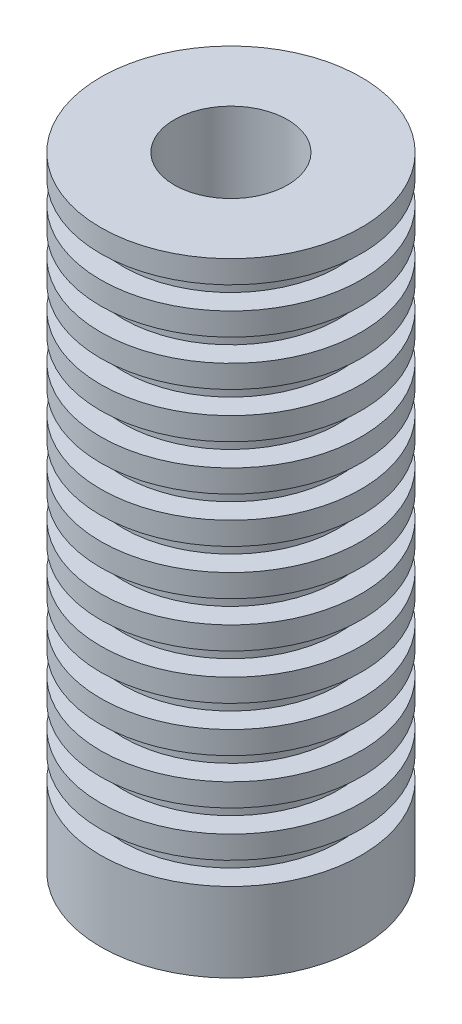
ISO-10303-21;
HEADER;
FILE_DESCRIPTION(('STEP AP214'),'2;1');
FILE_NAME('part.step','',(''),(''),'','','');
FILE_SCHEMA(('AUTOMOTIVE_DESIGN { 1 0 10303 214 1 1 1 1 }'));
ENDSEC;
DATA;
#1=APPLICATION_CONTEXT('core data for automotive mechanical design processes');
#2=APPLICATION_PROTOCOL_DEFINITION('international standard','automotive_design',2000,#1);
#3=PRODUCT_CONTEXT('',#1,'mechanical');
#4=PRODUCT('Part','Part','',(#3));
#5=PRODUCT_RELATED_PRODUCT_CATEGORY('part','',(#4));
#6=PRODUCT_DEFINITION_FORMATION('','',#4);
#7=PRODUCT_DEFINITION_CONTEXT('part definition',#1,'design');
#8=PRODUCT_DEFINITION('design','',#6,#7);
#9=PRODUCT_DEFINITION_SHAPE('','',#8);
#10=(LENGTH_UNIT() NAMED_UNIT(*) SI_UNIT(.MILLI.,.METRE.));
#11=(NAMED_UNIT(*) PLANE_ANGLE_UNIT() SI_UNIT($,.RADIAN.));
#12=(NAMED_UNIT(*) SI_UNIT($,.STERADIAN.) SOLID_ANGLE_UNIT());
#13=UNCERTAINTY_MEASURE_WITH_UNIT(LENGTH_MEASURE(1.E-05),#10,'distance_accuracy_value','');
#14=(GEOMETRIC_REPRESENTATION_CONTEXT(3) GLOBAL_UNCERTAINTY_ASSIGNED_CONTEXT((#13)) GLOBAL_UNIT_ASSIGNED_CONTEXT((#10,
#11,#12)) REPRESENTATION_CONTEXT('',''));
#15=CARTESIAN_POINT('',(0.,0.,0.));
#16=DIRECTION('',(0.,0.,1.));
#17=DIRECTION('',(1.,0.,0.));
#18=AXIS2_PLACEMENT_3D('',#15,#16,#17);
#19=CARTESIAN_POINT('',(0.,13.75,0.));
#20=DIRECTION('',(0.,-1.,0.));
#21=DIRECTION('',(0.,0.,-1.));
#22=AXIS2_PLACEMENT_3D('',#19,#20,#21);
#23=CYLINDRICAL_SURFACE('',#22,5.75);
#24=CARTESIAN_POINT('',(0.,10.75,0.));
#25=DIRECTION('',(0.,1.,0.));
#26=DIRECTION('',(0.,0.,1.));
#27=AXIS2_PLACEMENT_3D('',#24,#25,#26);
#28=CIRCLE('',#27,5.75);
#29=CARTESIAN_POINT('',(0.,10.75,5.75));
#30=VERTEX_POINT('',#29);
#31=EDGE_CURVE('E177',#30,#30,#28,.T.);
#32=ORIENTED_EDGE('',*,*,#31,.T.);
#33=EDGE_LOOP('',(#32));
#34=FACE_BOUND('',#33,.T.);
#35=CARTESIAN_POINT('',(0.,11.75,0.));
#36=DIRECTION('',(0.,1.,0.));
#37=DIRECTION('',(0.,0.,1.));
#38=AXIS2_PLACEMENT_3D('',#35,#36,#37);
#39=CIRCLE('',#38,5.75);
#40=CARTESIAN_POINT('',(0.,11.75,5.75));
#41=VERTEX_POINT('',#40);
#42=EDGE_CURVE('E180',#41,#41,#39,.T.);
#43=ORIENTED_EDGE('',*,*,#42,.F.);
#44=EDGE_LOOP('',(#43));
#45=FACE_BOUND('',#44,.T.);
#46=ADVANCED_FACE('F30',(#34,#45),#23,.T.);
#47=CARTESIAN_POINT('',(0.,13.75,0.));
#48=DIRECTION('',(0.,1.,0.));
#49=DIRECTION('',(0.,0.,1.));
#50=AXIS2_PLACEMENT_3D('',#47,#48,#49);
#51=CIRCLE('',#50,5.75);
#52=CARTESIAN_POINT('',(0.,13.75,5.75));
#53=VERTEX_POINT('',#52);
#54=EDGE_CURVE('E10',#53,#53,#51,.T.);
#55=ORIENTED_EDGE('',*,*,#54,.F.);
#56=EDGE_LOOP('',(#55));
#57=FACE_BOUND('',#56,.T.);
#58=CARTESIAN_POINT('',(0.,12.75,0.));
#59=DIRECTION('',(0.,1.,0.));
#60=DIRECTION('',(0.,0.,1.));
#61=AXIS2_PLACEMENT_3D('',#58,#59,#60);
#62=CIRCLE('',#61,5.75);
#63=CARTESIAN_POINT('',(0.,12.75,5.75));
#64=VERTEX_POINT('',#63);
#65=EDGE_CURVE('E189',#64,#64,#62,.T.);
#66=ORIENTED_EDGE('',*,*,#65,.T.);
#67=EDGE_LOOP('',(#66));
#68=FACE_BOUND('',#67,.T.);
#69=ADVANCED_FACE('F193',(#57,#68),#23,.T.);
#70=CARTESIAN_POINT('',(0.,8.75000000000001,0.));
#71=DIRECTION('',(0.,1.,0.));
#72=DIRECTION('',(0.,0.,1.));
#73=AXIS2_PLACEMENT_3D('',#70,#71,#72);
#74=CIRCLE('',#73,5.75);
#75=CARTESIAN_POINT('',(0.,8.75000000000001,5.75));
#76=VERTEX_POINT('',#75);
#77=EDGE_CURVE('E165',#76,#76,#74,.T.);
#78=ORIENTED_EDGE('',*,*,#77,.T.);
#79=EDGE_LOOP('',(#78));
#80=FACE_BOUND('',#79,.T.);
#81=CARTESIAN_POINT('',(0.,9.75,0.));
#82=DIRECTION('',(0.,1.,0.));
#83=DIRECTION('',(0.,0.,1.));
#84=AXIS2_PLACEMENT_3D('',#81,#82,#83);
#85=CIRCLE('',#84,5.75);
#86=CARTESIAN_POINT('',(0.,9.75,5.75));
#87=VERTEX_POINT('',#86);
#88=EDGE_CURVE('E168',#87,#87,#85,.T.);
#89=ORIENTED_EDGE('',*,*,#88,.F.);
#90=EDGE_LOOP('',(#89));
#91=FACE_BOUND('',#90,.T.);
#92=ADVANCED_FACE('F211',(#80,#91),#23,.T.);
#93=CARTESIAN_POINT('',(0.,6.75000000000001,0.));
#94=DIRECTION('',(0.,1.,0.));
#95=DIRECTION('',(0.,0.,1.));
#96=AXIS2_PLACEMENT_3D('',#93,#94,#95);
#97=CIRCLE('',#96,5.75);
#98=CARTESIAN_POINT('',(0.,6.75000000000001,5.75));
#99=VERTEX_POINT('',#98);
#100=EDGE_CURVE('E153',#99,#99,#97,.T.);
#101=ORIENTED_EDGE('',*,*,#100,.T.);
#102=EDGE_LOOP('',(#101));
#103=FACE_BOUND('',#102,.T.);
#104=CARTESIAN_POINT('',(0.,7.75000000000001,0.));
#105=DIRECTION('',(0.,1.,0.));
#106=DIRECTION('',(0.,0.,1.));
#107=AXIS2_PLACEMENT_3D('',#104,#105,#106);
#108=CIRCLE('',#107,5.75);
#109=CARTESIAN_POINT('',(0.,7.75000000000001,5.75));
#110=VERTEX_POINT('',#109);
#111=EDGE_CURVE('E156',#110,#110,#108,.T.);
#112=ORIENTED_EDGE('',*,*,#111,.F.);
#113=EDGE_LOOP('',(#112));
#114=FACE_BOUND('',#113,.T.);
#115=ADVANCED_FACE('F411',(#103,#114),#23,.T.);
#116=CARTESIAN_POINT('',(0.,4.75000000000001,0.));
#117=DIRECTION('',(0.,1.,0.));
#118=DIRECTION('',(0.,0.,1.));
#119=AXIS2_PLACEMENT_3D('',#116,#117,#118);
#120=CIRCLE('',#119,5.75);
#121=CARTESIAN_POINT('',(0.,4.75000000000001,5.75));
#122=VERTEX_POINT('',#121);
#123=EDGE_CURVE('E141',#122,#122,#120,.T.);
#124=ORIENTED_EDGE('',*,*,#123,.T.);
#125=EDGE_LOOP('',(#124));
#126=FACE_BOUND('',#125,.T.);
#127=CARTESIAN_POINT('',(0.,5.75,0.));
#128=DIRECTION('',(0.,1.,0.));
#129=DIRECTION('',(0.,0.,1.));
#130=AXIS2_PLACEMENT_3D('',#127,#128,#129);
#131=CIRCLE('',#130,5.75);
#132=CARTESIAN_POINT('',(0.,5.75,5.75));
#133=VERTEX_POINT('',#132);
#134=EDGE_CURVE('E144',#133,#133,#131,.T.);
#135=ORIENTED_EDGE('',*,*,#134,.F.);
#136=EDGE_LOOP('',(#135));
#137=FACE_BOUND('',#136,.T.);
#138=ADVANCED_FACE('F388',(#126,#137),#23,.T.);
#139=CARTESIAN_POINT('',(0.,2.75000000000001,0.));
#140=DIRECTION('',(0.,1.,0.));
#141=DIRECTION('',(0.,0.,1.));
#142=AXIS2_PLACEMENT_3D('',#139,#140,#141);
#143=CIRCLE('',#142,5.75);
#144=CARTESIAN_POINT('',(0.,2.75000000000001,5.75));
#145=VERTEX_POINT('',#144);
#146=EDGE_CURVE('E129',#145,#145,#143,.T.);
#147=ORIENTED_EDGE('',*,*,#146,.T.);
#148=EDGE_LOOP('',(#147));
#149=FACE_BOUND('',#148,.T.);
#150=CARTESIAN_POINT('',(0.,3.75,0.));
#151=DIRECTION('',(0.,1.,0.));
#152=DIRECTION('',(0.,0.,1.));
#153=AXIS2_PLACEMENT_3D('',#150,#151,#152);
#154=CIRCLE('',#153,5.75);
#155=CARTESIAN_POINT('',(0.,3.75,5.75));
#156=VERTEX_POINT('',#155);
#157=EDGE_CURVE('E132',#156,#156,#154,.T.);
#158=ORIENTED_EDGE('',*,*,#157,.F.);
#159=EDGE_LOOP('',(#158));
#160=FACE_BOUND('',#159,.T.);
#161=ADVANCED_FACE('F365',(#149,#160),#23,.T.);
#162=CARTESIAN_POINT('',(0.,0.750000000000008,0.));
#163=DIRECTION('',(0.,1.,0.));
#164=DIRECTION('',(0.,0.,1.));
#165=AXIS2_PLACEMENT_3D('',#162,#163,#164);
#166=CIRCLE('',#165,5.75);
#167=CARTESIAN_POINT('',(0.,0.750000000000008,5.75));
#168=VERTEX_POINT('',#167);
#169=EDGE_CURVE('E117',#168,#168,#166,.T.);
#170=ORIENTED_EDGE('',*,*,#169,.T.);
#171=EDGE_LOOP('',(#170));
#172=FACE_BOUND('',#171,.T.);
#173=CARTESIAN_POINT('',(0.,1.75,0.));
#174=DIRECTION('',(0.,1.,0.));
#175=DIRECTION('',(0.,0.,1.));
#176=AXIS2_PLACEMENT_3D('',#173,#174,#175);
#177=CIRCLE('',#176,5.75);
#178=CARTESIAN_POINT('',(0.,1.75,5.75));
#179=VERTEX_POINT('',#178);
#180=EDGE_CURVE('E120',#179,#179,#177,.T.);
#181=ORIENTED_EDGE('',*,*,#180,.F.);
#182=EDGE_LOOP('',(#181));
#183=FACE_BOUND('',#182,.T.);
#184=ADVANCED_FACE('F342',(#172,#183),#23,.T.);
#185=CARTESIAN_POINT('',(0.,-1.24999999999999,0.));
#186=DIRECTION('',(0.,1.,0.));
#187=DIRECTION('',(0.,0.,1.));
#188=AXIS2_PLACEMENT_3D('',#185,#186,#187);
#189=CIRCLE('',#188,5.75);
#190=CARTESIAN_POINT('',(0.,-1.24999999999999,5.75));
#191=VERTEX_POINT('',#190);
#192=EDGE_CURVE('E105',#191,#191,#189,.T.);
#193=ORIENTED_EDGE('',*,*,#192,.T.);
#194=EDGE_LOOP('',(#193));
#195=FACE_BOUND('',#194,.T.);
#196=CARTESIAN_POINT('',(0.,-0.249999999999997,0.));
#197=DIRECTION('',(0.,1.,0.));
#198=DIRECTION('',(0.,0.,1.));
#199=AXIS2_PLACEMENT_3D('',#196,#197,#198);
#200=CIRCLE('',#199,5.75);
#201=CARTESIAN_POINT('',(0.,-0.249999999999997,5.75));
#202=VERTEX_POINT('',#201);
#203=EDGE_CURVE('E108',#202,#202,#200,.T.);
#204=ORIENTED_EDGE('',*,*,#203,.F.);
#205=EDGE_LOOP('',(#204));
#206=FACE_BOUND('',#205,.T.);
#207=ADVANCED_FACE('F319',(#195,#206),#23,.T.);
#208=CARTESIAN_POINT('',(0.,-3.24999999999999,0.));
#209=DIRECTION('',(0.,1.,0.));
#210=DIRECTION('',(0.,0.,1.));
#211=AXIS2_PLACEMENT_3D('',#208,#209,#210);
#212=CIRCLE('',#211,5.75);
#213=CARTESIAN_POINT('',(0.,-3.24999999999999,5.75));
#214=VERTEX_POINT('',#213);
#215=EDGE_CURVE('E93',#214,#214,#212,.T.);
#216=ORIENTED_EDGE('',*,*,#215,.T.);
#217=EDGE_LOOP('',(#216));
#218=FACE_BOUND('',#217,.T.);
#219=CARTESIAN_POINT('',(0.,-2.25,0.));
#220=DIRECTION('',(0.,1.,0.));
#221=DIRECTION('',(0.,0.,1.));
#222=AXIS2_PLACEMENT_3D('',#219,#220,#221);
#223=CIRCLE('',#222,5.75);
#224=CARTESIAN_POINT('',(0.,-2.25,5.75));
#225=VERTEX_POINT('',#224);
#226=EDGE_CURVE('E96',#225,#225,#223,.T.);
#227=ORIENTED_EDGE('',*,*,#226,.F.);
#228=EDGE_LOOP('',(#227));
#229=FACE_BOUND('',#228,.T.);
#230=ADVANCED_FACE('F296',(#218,#229),#23,.T.);
#231=CARTESIAN_POINT('',(0.,-5.24999999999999,0.));
#232=DIRECTION('',(0.,1.,0.));
#233=DIRECTION('',(0.,0.,1.));
#234=AXIS2_PLACEMENT_3D('',#231,#232,#233);
#235=CIRCLE('',#234,5.75);
#236=CARTESIAN_POINT('',(0.,-5.24999999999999,5.75));
#237=VERTEX_POINT('',#236);
#238=EDGE_CURVE('E81',#237,#237,#235,.T.);
#239=ORIENTED_EDGE('',*,*,#238,.T.);
#240=EDGE_LOOP('',(#239));
#241=FACE_BOUND('',#240,.T.);
#242=CARTESIAN_POINT('',(0.,-4.25,0.));
#243=DIRECTION('',(0.,1.,0.));
#244=DIRECTION('',(0.,0.,1.));
#245=AXIS2_PLACEMENT_3D('',#242,#243,#244);
#246=CIRCLE('',#245,5.75);
#247=CARTESIAN_POINT('',(0.,-4.25,5.75));
#248=VERTEX_POINT('',#247);
#249=EDGE_CURVE('E84',#248,#248,#246,.T.);
#250=ORIENTED_EDGE('',*,*,#249,.F.);
#251=EDGE_LOOP('',(#250));
#252=FACE_BOUND('',#251,.T.);
#253=ADVANCED_FACE('F273',(#241,#252),#23,.T.);
#254=CARTESIAN_POINT('',(0.,-7.24999999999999,0.));
#255=DIRECTION('',(0.,1.,0.));
#256=DIRECTION('',(0.,0.,1.));
#257=AXIS2_PLACEMENT_3D('',#254,#255,#256);
#258=CIRCLE('',#257,5.75);
#259=CARTESIAN_POINT('',(0.,-7.24999999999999,5.75));
#260=VERTEX_POINT('',#259);
#261=EDGE_CURVE('E69',#260,#260,#258,.T.);
#262=ORIENTED_EDGE('',*,*,#261,.T.);
#263=EDGE_LOOP('',(#262));
#264=FACE_BOUND('',#263,.T.);
#265=CARTESIAN_POINT('',(0.,-6.25,0.));
#266=DIRECTION('',(0.,1.,0.));
#267=DIRECTION('',(0.,0.,1.));
#268=AXIS2_PLACEMENT_3D('',#265,#266,#267);
#269=CIRCLE('',#268,5.75);
#270=CARTESIAN_POINT('',(0.,-6.25,5.75));
#271=VERTEX_POINT('',#270);
#272=EDGE_CURVE('E72',#271,#271,#269,.T.);
#273=ORIENTED_EDGE('',*,*,#272,.F.);
#274=EDGE_LOOP('',(#273));
#275=FACE_BOUND('',#274,.T.);
#276=ADVANCED_FACE('F225',(#264,#275),#23,.T.);
#277=CARTESIAN_POINT('',(0.,-9.24999999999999,0.));
#278=DIRECTION('',(0.,1.,0.));
#279=DIRECTION('',(0.,0.,1.));
#280=AXIS2_PLACEMENT_3D('',#277,#278,#279);
#281=CIRCLE('',#280,5.75);
#282=CARTESIAN_POINT('',(0.,-9.24999999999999,5.75));
#283=VERTEX_POINT('',#282);
#284=EDGE_CURVE('E57',#283,#283,#281,.T.);
#285=ORIENTED_EDGE('',*,*,#284,.T.);
#286=EDGE_LOOP('',(#285));
#287=FACE_BOUND('',#286,.T.);
#288=CARTESIAN_POINT('',(0.,-8.25,0.));
#289=DIRECTION('',(0.,1.,0.));
#290=DIRECTION('',(0.,0.,1.));
#291=AXIS2_PLACEMENT_3D('',#288,#289,#290);
#292=CIRCLE('',#291,5.75);
#293=CARTESIAN_POINT('',(0.,-8.25,5.75));
#294=VERTEX_POINT('',#293);
#295=EDGE_CURVE('E60',#294,#294,#292,.T.);
#296=ORIENTED_EDGE('',*,*,#295,.F.);
#297=EDGE_LOOP('',(#296));
#298=FACE_BOUND('',#297,.T.);
#299=ADVANCED_FACE('F216',(#287,#298),#23,.T.);
#300=CARTESIAN_POINT('',(0.,-13.75,0.));
#301=DIRECTION('',(0.,1.,0.));
#302=DIRECTION('',(0.,0.,1.));
#303=AXIS2_PLACEMENT_3D('',#300,#301,#302);
#304=CIRCLE('',#303,5.75);
#305=CARTESIAN_POINT('',(0.,-13.75,5.75));
#306=VERTEX_POINT('',#305);
#307=EDGE_CURVE('E34',#306,#306,#304,.T.);
#308=ORIENTED_EDGE('',*,*,#307,.T.);
#309=EDGE_LOOP('',(#308));
#310=FACE_BOUND('',#309,.T.);
#311=CARTESIAN_POINT('',(0.,-10.25,0.));
#312=DIRECTION('',(0.,1.,0.));
#313=DIRECTION('',(0.,0.,1.));
#314=AXIS2_PLACEMENT_3D('',#311,#312,#313);
#315=CIRCLE('',#314,5.75);
#316=CARTESIAN_POINT('',(0.,-10.25,5.75));
#317=VERTEX_POINT('',#316);
#318=EDGE_CURVE('E48',#317,#317,#315,.T.);
#319=ORIENTED_EDGE('',*,*,#318,.F.);
#320=EDGE_LOOP('',(#319));
#321=FACE_BOUND('',#320,.T.);
#322=ADVANCED_FACE('F32',(#310,#321),#23,.T.);
#323=CARTESIAN_POINT('',(0.,13.75,0.));
#324=DIRECTION('',(0.,1.,0.));
#325=DIRECTION('',(0.,0.,1.));
#326=AXIS2_PLACEMENT_3D('',#323,#324,#325);
#327=PLANE('',#326);
#328=CARTESIAN_POINT('',(0.,13.75,0.));
#329=DIRECTION('',(0.,1.,0.));
#330=DIRECTION('',(0.,0.,1.));
#331=AXIS2_PLACEMENT_3D('',#328,#329,#330);
#332=CIRCLE('',#331,2.5);
#333=CARTESIAN_POINT('',(0.,13.75,2.5));
#334=VERTEX_POINT('',#333);
#335=EDGE_CURVE('E45',#334,#334,#332,.T.);
#336=ORIENTED_EDGE('',*,*,#335,.F.);
#337=EDGE_LOOP('',(#336));
#338=FACE_BOUND('',#337,.T.);
#339=ORIENTED_EDGE('',*,*,#54,.T.);
#340=EDGE_LOOP('',(#339));
#341=FACE_BOUND('',#340,.T.);
#342=ADVANCED_FACE('F215',(#338,#341),#327,.T.);
#343=CARTESIAN_POINT('',(0.,-13.75,0.));
#344=DIRECTION('',(0.,1.,0.));
#345=DIRECTION('',(0.,0.,1.));
#346=AXIS2_PLACEMENT_3D('',#343,#344,#345);
#347=PLANE('',#346);
#348=CARTESIAN_POINT('',(0.,-13.75,0.));
#349=DIRECTION('',(0.,1.,0.));
#350=DIRECTION('',(0.,0.,1.));
#351=AXIS2_PLACEMENT_3D('',#348,#349,#350);
#352=CIRCLE('',#351,2.5);
#353=CARTESIAN_POINT('',(0.,-13.75,2.5));
#354=VERTEX_POINT('',#353);
#355=EDGE_CURVE('E41',#354,#354,#352,.T.);
#356=ORIENTED_EDGE('',*,*,#355,.T.);
#357=EDGE_LOOP('',(#356));
#358=FACE_BOUND('',#357,.T.);
#359=ORIENTED_EDGE('',*,*,#307,.F.);
#360=EDGE_LOOP('',(#359));
#361=FACE_BOUND('',#360,.T.);
#362=ADVANCED_FACE('F222',(#358,#361),#347,.F.);
#363=CARTESIAN_POINT('',(0.,-13.75,0.));
#364=DIRECTION('',(0.,1.,0.));
#365=DIRECTION('',(0.,0.,1.));
#366=AXIS2_PLACEMENT_3D('',#363,#364,#365);
#367=CYLINDRICAL_SURFACE('',#366,2.5);
#368=ORIENTED_EDGE('',*,*,#355,.F.);
#369=EDGE_LOOP('',(#368));
#370=FACE_BOUND('',#369,.T.);
#371=ORIENTED_EDGE('',*,*,#335,.T.);
#372=EDGE_LOOP('',(#371));
#373=FACE_BOUND('',#372,.T.);
#374=ADVANCED_FACE('F235',(#370,#373),#367,.F.);
#375=CARTESIAN_POINT('',(5.75,-10.25,0.));
#376=DIRECTION('',(0.,1.,0.));
#377=DIRECTION('',(0.,0.,1.));
#378=AXIS2_PLACEMENT_3D('',#375,#376,#377);
#379=PLANE('',#378);
#380=ORIENTED_EDGE('',*,*,#318,.T.);
#381=EDGE_LOOP('',(#380));
#382=FACE_BOUND('',#381,.T.);
#383=CARTESIAN_POINT('',(0.,-10.25,0.));
#384=DIRECTION('',(0.,1.,0.));
#385=DIRECTION('',(0.,0.,1.));
#386=AXIS2_PLACEMENT_3D('',#383,#384,#385);
#387=CIRCLE('',#386,4.75);
#388=CARTESIAN_POINT('',(0.,-10.25,4.75));
#389=VERTEX_POINT('',#388);
#390=EDGE_CURVE('E51',#389,#389,#387,.T.);
#391=ORIENTED_EDGE('',*,*,#390,.F.);
#392=EDGE_LOOP('',(#391));
#393=FACE_BOUND('',#392,.T.);
#394=ADVANCED_FACE('F231',(#382,#393),#379,.T.);
#395=CARTESIAN_POINT('',(0.,13.75,0.));
#396=DIRECTION('',(0.,1.,0.));
#397=DIRECTION('',(0.,0.,1.));
#398=AXIS2_PLACEMENT_3D('',#395,#396,#397);
#399=CYLINDRICAL_SURFACE('',#398,4.75);
#400=ORIENTED_EDGE('',*,*,#390,.T.);
#401=EDGE_LOOP('',(#400));
#402=FACE_BOUND('',#401,.T.);
#403=CARTESIAN_POINT('',(0.,-9.25,0.));
#404=DIRECTION('',(0.,1.,0.));
#405=DIRECTION('',(0.,0.,1.));
#406=AXIS2_PLACEMENT_3D('',#403,#404,#405);
#407=CIRCLE('',#406,4.75);
#408=CARTESIAN_POINT('',(0.,-9.25,4.75));
#409=VERTEX_POINT('',#408);
#410=EDGE_CURVE('E54',#409,#409,#407,.T.);
#411=ORIENTED_EDGE('',*,*,#410,.F.);
#412=EDGE_LOOP('',(#411));
#413=FACE_BOUND('',#412,.T.);
#414=ADVANCED_FACE('F234',(#402,#413),#399,.T.);
#415=CARTESIAN_POINT('',(5.75,-9.24999999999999,0.));
#416=DIRECTION('',(0.,-1.,0.));
#417=DIRECTION('',(0.,0.,-1.));
#418=AXIS2_PLACEMENT_3D('',#415,#416,#417);
#419=PLANE('',#418);
#420=ORIENTED_EDGE('',*,*,#410,.T.);
#421=EDGE_LOOP('',(#420));
#422=FACE_BOUND('',#421,.T.);
#423=ORIENTED_EDGE('',*,*,#284,.F.);
#424=EDGE_LOOP('',(#423));
#425=FACE_BOUND('',#424,.T.);
#426=ADVANCED_FACE('F241',(#422,#425),#419,.T.);
#427=CARTESIAN_POINT('',(5.75,-8.25,0.));
#428=DIRECTION('',(0.,1.,0.));
#429=DIRECTION('',(0.,0.,1.));
#430=AXIS2_PLACEMENT_3D('',#427,#428,#429);
#431=PLANE('',#430);
#432=ORIENTED_EDGE('',*,*,#295,.T.);
#433=EDGE_LOOP('',(#432));
#434=FACE_BOUND('',#433,.T.);
#435=CARTESIAN_POINT('',(0.,-8.25,0.));
#436=DIRECTION('',(0.,1.,0.));
#437=DIRECTION('',(0.,0.,1.));
#438=AXIS2_PLACEMENT_3D('',#435,#436,#437);
#439=CIRCLE('',#438,4.75);
#440=CARTESIAN_POINT('',(0.,-8.25,4.75));
#441=VERTEX_POINT('',#440);
#442=EDGE_CURVE('E63',#441,#441,#439,.T.);
#443=ORIENTED_EDGE('',*,*,#442,.F.);
#444=EDGE_LOOP('',(#443));
#445=FACE_BOUND('',#444,.T.);
#446=ADVANCED_FACE('F247',(#434,#445),#431,.T.);
#447=CARTESIAN_POINT('',(0.,15.75,0.));
#448=DIRECTION('',(0.,1.,0.));
#449=DIRECTION('',(0.,0.,1.));
#450=AXIS2_PLACEMENT_3D('',#447,#448,#449);
#451=CYLINDRICAL_SURFACE('',#450,4.75);
#452=ORIENTED_EDGE('',*,*,#442,.T.);
#453=EDGE_LOOP('',(#452));
#454=FACE_BOUND('',#453,.T.);
#455=CARTESIAN_POINT('',(0.,-7.25,0.));
#456=DIRECTION('',(0.,1.,0.));
#457=DIRECTION('',(0.,0.,1.));
#458=AXIS2_PLACEMENT_3D('',#455,#456,#457);
#459=CIRCLE('',#458,4.75);
#460=CARTESIAN_POINT('',(0.,-7.25,4.75));
#461=VERTEX_POINT('',#460);
#462=EDGE_CURVE('E66',#461,#461,#459,.T.);
#463=ORIENTED_EDGE('',*,*,#462,.F.);
#464=EDGE_LOOP('',(#463));
#465=FACE_BOUND('',#464,.T.);
#466=ADVANCED_FACE('F255',(#454,#465),#451,.T.);
#467=CARTESIAN_POINT('',(5.75,-7.24999999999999,0.));
#468=DIRECTION('',(0.,-1.,0.));
#469=DIRECTION('',(0.,0.,-1.));
#470=AXIS2_PLACEMENT_3D('',#467,#468,#469);
#471=PLANE('',#470);
#472=ORIENTED_EDGE('',*,*,#462,.T.);
#473=EDGE_LOOP('',(#472));
#474=FACE_BOUND('',#473,.T.);
#475=ORIENTED_EDGE('',*,*,#261,.F.);
#476=EDGE_LOOP('',(#475));
#477=FACE_BOUND('',#476,.T.);
#478=ADVANCED_FACE('F261',(#474,#477),#471,.T.);
#479=CARTESIAN_POINT('',(5.75,-6.25,0.));
#480=DIRECTION('',(0.,1.,0.));
#481=DIRECTION('',(0.,0.,1.));
#482=AXIS2_PLACEMENT_3D('',#479,#480,#481);
#483=PLANE('',#482);
#484=ORIENTED_EDGE('',*,*,#272,.T.);
#485=EDGE_LOOP('',(#484));
#486=FACE_BOUND('',#485,.T.);
#487=CARTESIAN_POINT('',(0.,-6.25,0.));
#488=DIRECTION('',(0.,1.,0.));
#489=DIRECTION('',(0.,0.,1.));
#490=AXIS2_PLACEMENT_3D('',#487,#488,#489);
#491=CIRCLE('',#490,4.75);
#492=CARTESIAN_POINT('',(0.,-6.25,4.75));
#493=VERTEX_POINT('',#492);
#494=EDGE_CURVE('E75',#493,#493,#491,.T.);
#495=ORIENTED_EDGE('',*,*,#494,.F.);
#496=EDGE_LOOP('',(#495));
#497=FACE_BOUND('',#496,.T.);
#498=ADVANCED_FACE('F267',(#486,#497),#483,.T.);
#499=CARTESIAN_POINT('',(0.,17.75,0.));
#500=DIRECTION('',(0.,1.,0.));
#501=DIRECTION('',(0.,0.,1.));
#502=AXIS2_PLACEMENT_3D('',#499,#500,#501);
#503=CYLINDRICAL_SURFACE('',#502,4.75);
#504=ORIENTED_EDGE('',*,*,#494,.T.);
#505=EDGE_LOOP('',(#504));
#506=FACE_BOUND('',#505,.T.);
#507=CARTESIAN_POINT('',(0.,-5.25,0.));
#508=DIRECTION('',(0.,1.,0.));
#509=DIRECTION('',(0.,0.,1.));
#510=AXIS2_PLACEMENT_3D('',#507,#508,#509);
#511=CIRCLE('',#510,4.75);
#512=CARTESIAN_POINT('',(0.,-5.25,4.75));
#513=VERTEX_POINT('',#512);
#514=EDGE_CURVE('E78',#513,#513,#511,.T.);
#515=ORIENTED_EDGE('',*,*,#514,.F.);
#516=EDGE_LOOP('',(#515));
#517=FACE_BOUND('',#516,.T.);
#518=ADVANCED_FACE('F278',(#506,#517),#503,.T.);
#519=CARTESIAN_POINT('',(5.75,-5.24999999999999,0.));
#520=DIRECTION('',(0.,-1.,0.));
#521=DIRECTION('',(0.,0.,-1.));
#522=AXIS2_PLACEMENT_3D('',#519,#520,#521);
#523=PLANE('',#522);
#524=ORIENTED_EDGE('',*,*,#514,.T.);
#525=EDGE_LOOP('',(#524));
#526=FACE_BOUND('',#525,.T.);
#527=ORIENTED_EDGE('',*,*,#238,.F.);
#528=EDGE_LOOP('',(#527));
#529=FACE_BOUND('',#528,.T.);
#530=ADVANCED_FACE('F284',(#526,#529),#523,.T.);
#531=CARTESIAN_POINT('',(5.75,-4.25,0.));
#532=DIRECTION('',(0.,1.,0.));
#533=DIRECTION('',(0.,0.,1.));
#534=AXIS2_PLACEMENT_3D('',#531,#532,#533);
#535=PLANE('',#534);
#536=ORIENTED_EDGE('',*,*,#249,.T.);
#537=EDGE_LOOP('',(#536));
#538=FACE_BOUND('',#537,.T.);
#539=CARTESIAN_POINT('',(0.,-4.25,0.));
#540=DIRECTION('',(0.,1.,0.));
#541=DIRECTION('',(0.,0.,1.));
#542=AXIS2_PLACEMENT_3D('',#539,#540,#541);
#543=CIRCLE('',#542,4.75);
#544=CARTESIAN_POINT('',(0.,-4.25,4.75));
#545=VERTEX_POINT('',#544);
#546=EDGE_CURVE('E87',#545,#545,#543,.T.);
#547=ORIENTED_EDGE('',*,*,#546,.F.);
#548=EDGE_LOOP('',(#547));
#549=FACE_BOUND('',#548,.T.);
#550=ADVANCED_FACE('F290',(#538,#549),#535,.T.);
#551=CARTESIAN_POINT('',(0.,19.75,0.));
#552=DIRECTION('',(0.,1.,0.));
#553=DIRECTION('',(0.,0.,1.));
#554=AXIS2_PLACEMENT_3D('',#551,#552,#553);
#555=CYLINDRICAL_SURFACE('',#554,4.75);
#556=ORIENTED_EDGE('',*,*,#546,.T.);
#557=EDGE_LOOP('',(#556));
#558=FACE_BOUND('',#557,.T.);
#559=CARTESIAN_POINT('',(0.,-3.25,0.));
#560=DIRECTION('',(0.,1.,0.));
#561=DIRECTION('',(0.,0.,1.));
#562=AXIS2_PLACEMENT_3D('',#559,#560,#561);
#563=CIRCLE('',#562,4.75);
#564=CARTESIAN_POINT('',(0.,-3.25,4.75));
#565=VERTEX_POINT('',#564);
#566=EDGE_CURVE('E90',#565,#565,#563,.T.);
#567=ORIENTED_EDGE('',*,*,#566,.F.);
#568=EDGE_LOOP('',(#567));
#569=FACE_BOUND('',#568,.T.);
#570=ADVANCED_FACE('F301',(#558,#569),#555,.T.);
#571=CARTESIAN_POINT('',(5.75,-3.24999999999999,0.));
#572=DIRECTION('',(0.,-1.,0.));
#573=DIRECTION('',(0.,0.,-1.));
#574=AXIS2_PLACEMENT_3D('',#571,#572,#573);
#575=PLANE('',#574);
#576=ORIENTED_EDGE('',*,*,#566,.T.);
#577=EDGE_LOOP('',(#576));
#578=FACE_BOUND('',#577,.T.);
#579=ORIENTED_EDGE('',*,*,#215,.F.);
#580=EDGE_LOOP('',(#579));
#581=FACE_BOUND('',#580,.T.);
#582=ADVANCED_FACE('F307',(#578,#581),#575,.T.);
#583=CARTESIAN_POINT('',(5.75,-2.25,0.));
#584=DIRECTION('',(0.,1.,0.));
#585=DIRECTION('',(0.,0.,1.));
#586=AXIS2_PLACEMENT_3D('',#583,#584,#585);
#587=PLANE('',#586);
#588=ORIENTED_EDGE('',*,*,#226,.T.);
#589=EDGE_LOOP('',(#588));
#590=FACE_BOUND('',#589,.T.);
#591=CARTESIAN_POINT('',(0.,-2.25,0.));
#592=DIRECTION('',(0.,1.,0.));
#593=DIRECTION('',(0.,0.,1.));
#594=AXIS2_PLACEMENT_3D('',#591,#592,#593);
#595=CIRCLE('',#594,4.75);
#596=CARTESIAN_POINT('',(0.,-2.25,4.75));
#597=VERTEX_POINT('',#596);
#598=EDGE_CURVE('E99',#597,#597,#595,.T.);
#599=ORIENTED_EDGE('',*,*,#598,.F.);
#600=EDGE_LOOP('',(#599));
#601=FACE_BOUND('',#600,.T.);
#602=ADVANCED_FACE('F313',(#590,#601),#587,.T.);
#603=CARTESIAN_POINT('',(0.,21.75,0.));
#604=DIRECTION('',(0.,1.,0.));
#605=DIRECTION('',(0.,0.,1.));
#606=AXIS2_PLACEMENT_3D('',#603,#604,#605);
#607=CYLINDRICAL_SURFACE('',#606,4.75);
#608=ORIENTED_EDGE('',*,*,#598,.T.);
#609=EDGE_LOOP('',(#608));
#610=FACE_BOUND('',#609,.T.);
#611=CARTESIAN_POINT('',(0.,-1.25,0.));
#612=DIRECTION('',(0.,1.,0.));
#613=DIRECTION('',(0.,0.,1.));
#614=AXIS2_PLACEMENT_3D('',#611,#612,#613);
#615=CIRCLE('',#614,4.75);
#616=CARTESIAN_POINT('',(0.,-1.25,4.75));
#617=VERTEX_POINT('',#616);
#618=EDGE_CURVE('E102',#617,#617,#615,.T.);
#619=ORIENTED_EDGE('',*,*,#618,.F.);
#620=EDGE_LOOP('',(#619));
#621=FACE_BOUND('',#620,.T.);
#622=ADVANCED_FACE('F324',(#610,#621),#607,.T.);
#623=CARTESIAN_POINT('',(5.75,-1.24999999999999,0.));
#624=DIRECTION('',(0.,-1.,0.));
#625=DIRECTION('',(0.,0.,-1.));
#626=AXIS2_PLACEMENT_3D('',#623,#624,#625);
#627=PLANE('',#626);
#628=ORIENTED_EDGE('',*,*,#618,.T.);
#629=EDGE_LOOP('',(#628));
#630=FACE_BOUND('',#629,.T.);
#631=ORIENTED_EDGE('',*,*,#192,.F.);
#632=EDGE_LOOP('',(#631));
#633=FACE_BOUND('',#632,.T.);
#634=ADVANCED_FACE('F330',(#630,#633),#627,.T.);
#635=CARTESIAN_POINT('',(5.75,-0.25,0.));
#636=DIRECTION('',(0.,1.,0.));
#637=DIRECTION('',(0.,0.,1.));
#638=AXIS2_PLACEMENT_3D('',#635,#636,#637);
#639=PLANE('',#638);
#640=ORIENTED_EDGE('',*,*,#203,.T.);
#641=EDGE_LOOP('',(#640));
#642=FACE_BOUND('',#641,.T.);
#643=CARTESIAN_POINT('',(0.,-0.250000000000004,0.));
#644=DIRECTION('',(0.,1.,0.));
#645=DIRECTION('',(0.,0.,1.));
#646=AXIS2_PLACEMENT_3D('',#643,#644,#645);
#647=CIRCLE('',#646,4.75);
#648=CARTESIAN_POINT('',(0.,-0.250000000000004,4.75));
#649=VERTEX_POINT('',#648);
#650=EDGE_CURVE('E111',#649,#649,#647,.T.);
#651=ORIENTED_EDGE('',*,*,#650,.F.);
#652=EDGE_LOOP('',(#651));
#653=FACE_BOUND('',#652,.T.);
#654=ADVANCED_FACE('F336',(#642,#653),#639,.T.);
#655=CARTESIAN_POINT('',(0.,23.75,0.));
#656=DIRECTION('',(0.,1.,0.));
#657=DIRECTION('',(0.,0.,1.));
#658=AXIS2_PLACEMENT_3D('',#655,#656,#657);
#659=CYLINDRICAL_SURFACE('',#658,4.75);
#660=ORIENTED_EDGE('',*,*,#650,.T.);
#661=EDGE_LOOP('',(#660));
#662=FACE_BOUND('',#661,.T.);
#663=CARTESIAN_POINT('',(0.,0.750000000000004,0.));
#664=DIRECTION('',(0.,1.,0.));
#665=DIRECTION('',(0.,0.,1.));
#666=AXIS2_PLACEMENT_3D('',#663,#664,#665);
#667=CIRCLE('',#666,4.75);
#668=CARTESIAN_POINT('',(0.,0.750000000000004,4.75));
#669=VERTEX_POINT('',#668);
#670=EDGE_CURVE('E114',#669,#669,#667,.T.);
#671=ORIENTED_EDGE('',*,*,#670,.F.);
#672=EDGE_LOOP('',(#671));
#673=FACE_BOUND('',#672,.T.);
#674=ADVANCED_FACE('F347',(#662,#673),#659,.T.);
#675=CARTESIAN_POINT('',(5.75,0.750000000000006,0.));
#676=DIRECTION('',(0.,-1.,0.));
#677=DIRECTION('',(0.,0.,-1.));
#678=AXIS2_PLACEMENT_3D('',#675,#676,#677);
#679=PLANE('',#678);
#680=ORIENTED_EDGE('',*,*,#670,.T.);
#681=EDGE_LOOP('',(#680));
#682=FACE_BOUND('',#681,.T.);
#683=ORIENTED_EDGE('',*,*,#169,.F.);
#684=EDGE_LOOP('',(#683));
#685=FACE_BOUND('',#684,.T.);
#686=ADVANCED_FACE('F353',(#682,#685),#679,.T.);
#687=CARTESIAN_POINT('',(5.75,1.75,0.));
#688=DIRECTION('',(0.,1.,0.));
#689=DIRECTION('',(0.,0.,1.));
#690=AXIS2_PLACEMENT_3D('',#687,#688,#689);
#691=PLANE('',#690);
#692=ORIENTED_EDGE('',*,*,#180,.T.);
#693=EDGE_LOOP('',(#692));
#694=FACE_BOUND('',#693,.T.);
#695=CARTESIAN_POINT('',(0.,1.75,0.));
#696=DIRECTION('',(0.,1.,0.));
#697=DIRECTION('',(0.,0.,1.));
#698=AXIS2_PLACEMENT_3D('',#695,#696,#697);
#699=CIRCLE('',#698,4.75);
#700=CARTESIAN_POINT('',(0.,1.75,4.75));
#701=VERTEX_POINT('',#700);
#702=EDGE_CURVE('E123',#701,#701,#699,.T.);
#703=ORIENTED_EDGE('',*,*,#702,.F.);
#704=EDGE_LOOP('',(#703));
#705=FACE_BOUND('',#704,.T.);
#706=ADVANCED_FACE('F359',(#694,#705),#691,.T.);
#707=CARTESIAN_POINT('',(0.,25.75,0.));
#708=DIRECTION('',(0.,1.,0.));
#709=DIRECTION('',(0.,0.,1.));
#710=AXIS2_PLACEMENT_3D('',#707,#708,#709);
#711=CYLINDRICAL_SURFACE('',#710,4.75);
#712=ORIENTED_EDGE('',*,*,#702,.T.);
#713=EDGE_LOOP('',(#712));
#714=FACE_BOUND('',#713,.T.);
#715=CARTESIAN_POINT('',(0.,2.75,0.));
#716=DIRECTION('',(0.,1.,0.));
#717=DIRECTION('',(0.,0.,1.));
#718=AXIS2_PLACEMENT_3D('',#715,#716,#717);
#719=CIRCLE('',#718,4.75);
#720=CARTESIAN_POINT('',(0.,2.75,4.75));
#721=VERTEX_POINT('',#720);
#722=EDGE_CURVE('E126',#721,#721,#719,.T.);
#723=ORIENTED_EDGE('',*,*,#722,.F.);
#724=EDGE_LOOP('',(#723));
#725=FACE_BOUND('',#724,.T.);
#726=ADVANCED_FACE('F370',(#714,#725),#711,.T.);
#727=CARTESIAN_POINT('',(5.75,2.75000000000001,0.));
#728=DIRECTION('',(0.,-1.,0.));
#729=DIRECTION('',(0.,0.,-1.));
#730=AXIS2_PLACEMENT_3D('',#727,#728,#729);
#731=PLANE('',#730);
#732=ORIENTED_EDGE('',*,*,#722,.T.);
#733=EDGE_LOOP('',(#732));
#734=FACE_BOUND('',#733,.T.);
#735=ORIENTED_EDGE('',*,*,#146,.F.);
#736=EDGE_LOOP('',(#735));
#737=FACE_BOUND('',#736,.T.);
#738=ADVANCED_FACE('F376',(#734,#737),#731,.T.);
#739=CARTESIAN_POINT('',(5.75,3.75,0.));
#740=DIRECTION('',(0.,1.,0.));
#741=DIRECTION('',(0.,0.,1.));
#742=AXIS2_PLACEMENT_3D('',#739,#740,#741);
#743=PLANE('',#742);
#744=ORIENTED_EDGE('',*,*,#157,.T.);
#745=EDGE_LOOP('',(#744));
#746=FACE_BOUND('',#745,.T.);
#747=CARTESIAN_POINT('',(0.,3.75,0.));
#748=DIRECTION('',(0.,1.,0.));
#749=DIRECTION('',(0.,0.,1.));
#750=AXIS2_PLACEMENT_3D('',#747,#748,#749);
#751=CIRCLE('',#750,4.75);
#752=CARTESIAN_POINT('',(0.,3.75,4.75));
#753=VERTEX_POINT('',#752);
#754=EDGE_CURVE('E135',#753,#753,#751,.T.);
#755=ORIENTED_EDGE('',*,*,#754,.F.);
#756=EDGE_LOOP('',(#755));
#757=FACE_BOUND('',#756,.T.);
#758=ADVANCED_FACE('F382',(#746,#757),#743,.T.);
#759=CARTESIAN_POINT('',(0.,27.75,0.));
#760=DIRECTION('',(0.,1.,0.));
#761=DIRECTION('',(0.,0.,1.));
#762=AXIS2_PLACEMENT_3D('',#759,#760,#761);
#763=CYLINDRICAL_SURFACE('',#762,4.75);
#764=ORIENTED_EDGE('',*,*,#754,.T.);
#765=EDGE_LOOP('',(#764));
#766=FACE_BOUND('',#765,.T.);
#767=CARTESIAN_POINT('',(0.,4.75,0.));
#768=DIRECTION('',(0.,1.,0.));
#769=DIRECTION('',(0.,0.,1.));
#770=AXIS2_PLACEMENT_3D('',#767,#768,#769);
#771=CIRCLE('',#770,4.75);
#772=CARTESIAN_POINT('',(0.,4.75,4.75));
#773=VERTEX_POINT('',#772);
#774=EDGE_CURVE('E138',#773,#773,#771,.T.);
#775=ORIENTED_EDGE('',*,*,#774,.F.);
#776=EDGE_LOOP('',(#775));
#777=FACE_BOUND('',#776,.T.);
#778=ADVANCED_FACE('F393',(#766,#777),#763,.T.);
#779=CARTESIAN_POINT('',(5.75,4.75000000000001,0.));
#780=DIRECTION('',(0.,-1.,0.));
#781=DIRECTION('',(0.,0.,-1.));
#782=AXIS2_PLACEMENT_3D('',#779,#780,#781);
#783=PLANE('',#782);
#784=ORIENTED_EDGE('',*,*,#774,.T.);
#785=EDGE_LOOP('',(#784));
#786=FACE_BOUND('',#785,.T.);
#787=ORIENTED_EDGE('',*,*,#123,.F.);
#788=EDGE_LOOP('',(#787));
#789=FACE_BOUND('',#788,.T.);
#790=ADVANCED_FACE('F399',(#786,#789),#783,.T.);
#791=CARTESIAN_POINT('',(5.75,5.75,0.));
#792=DIRECTION('',(0.,1.,0.));
#793=DIRECTION('',(0.,0.,1.));
#794=AXIS2_PLACEMENT_3D('',#791,#792,#793);
#795=PLANE('',#794);
#796=ORIENTED_EDGE('',*,*,#134,.T.);
#797=EDGE_LOOP('',(#796));
#798=FACE_BOUND('',#797,.T.);
#799=CARTESIAN_POINT('',(0.,5.75,0.));
#800=DIRECTION('',(0.,1.,0.));
#801=DIRECTION('',(0.,0.,1.));
#802=AXIS2_PLACEMENT_3D('',#799,#800,#801);
#803=CIRCLE('',#802,4.75);
#804=CARTESIAN_POINT('',(0.,5.75,4.75));
#805=VERTEX_POINT('',#804);
#806=EDGE_CURVE('E147',#805,#805,#803,.T.);
#807=ORIENTED_EDGE('',*,*,#806,.F.);
#808=EDGE_LOOP('',(#807));
#809=FACE_BOUND('',#808,.T.);
#810=ADVANCED_FACE('F405',(#798,#809),#795,.T.);
#811=CARTESIAN_POINT('',(0.,29.75,0.));
#812=DIRECTION('',(0.,1.,0.));
#813=DIRECTION('',(0.,0.,1.));
#814=AXIS2_PLACEMENT_3D('',#811,#812,#813);
#815=CYLINDRICAL_SURFACE('',#814,4.75);
#816=ORIENTED_EDGE('',*,*,#806,.T.);
#817=EDGE_LOOP('',(#816));
#818=FACE_BOUND('',#817,.T.);
#819=CARTESIAN_POINT('',(0.,6.75,0.));
#820=DIRECTION('',(0.,1.,0.));
#821=DIRECTION('',(0.,0.,1.));
#822=AXIS2_PLACEMENT_3D('',#819,#820,#821);
#823=CIRCLE('',#822,4.75);
#824=CARTESIAN_POINT('',(0.,6.75,4.75));
#825=VERTEX_POINT('',#824);
#826=EDGE_CURVE('E150',#825,#825,#823,.T.);
#827=ORIENTED_EDGE('',*,*,#826,.F.);
#828=EDGE_LOOP('',(#827));
#829=FACE_BOUND('',#828,.T.);
#830=ADVANCED_FACE('F416',(#818,#829),#815,.T.);
#831=CARTESIAN_POINT('',(5.75,6.75000000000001,0.));
#832=DIRECTION('',(0.,-1.,0.));
#833=DIRECTION('',(0.,0.,-1.));
#834=AXIS2_PLACEMENT_3D('',#831,#832,#833);
#835=PLANE('',#834);
#836=ORIENTED_EDGE('',*,*,#826,.T.);
#837=EDGE_LOOP('',(#836));
#838=FACE_BOUND('',#837,.T.);
#839=ORIENTED_EDGE('',*,*,#100,.F.);
#840=EDGE_LOOP('',(#839));
#841=FACE_BOUND('',#840,.T.);
#842=ADVANCED_FACE('F422',(#838,#841),#835,.T.);
#843=CARTESIAN_POINT('',(5.75,7.75,0.));
#844=DIRECTION('',(0.,1.,0.));
#845=DIRECTION('',(0.,0.,1.));
#846=AXIS2_PLACEMENT_3D('',#843,#844,#845);
#847=PLANE('',#846);
#848=ORIENTED_EDGE('',*,*,#111,.T.);
#849=EDGE_LOOP('',(#848));
#850=FACE_BOUND('',#849,.T.);
#851=CARTESIAN_POINT('',(0.,7.75,0.));
#852=DIRECTION('',(0.,1.,0.));
#853=DIRECTION('',(0.,0.,1.));
#854=AXIS2_PLACEMENT_3D('',#851,#852,#853);
#855=CIRCLE('',#854,4.75);
#856=CARTESIAN_POINT('',(0.,7.75,4.75));
#857=VERTEX_POINT('',#856);
#858=EDGE_CURVE('E159',#857,#857,#855,.T.);
#859=ORIENTED_EDGE('',*,*,#858,.F.);
#860=EDGE_LOOP('',(#859));
#861=FACE_BOUND('',#860,.T.);
#862=ADVANCED_FACE('F428',(#850,#861),#847,.T.);
#863=CARTESIAN_POINT('',(0.,31.75,0.));
#864=DIRECTION('',(0.,1.,0.));
#865=DIRECTION('',(0.,0.,1.));
#866=AXIS2_PLACEMENT_3D('',#863,#864,#865);
#867=CYLINDRICAL_SURFACE('',#866,4.75);
#868=ORIENTED_EDGE('',*,*,#858,.T.);
#869=EDGE_LOOP('',(#868));
#870=FACE_BOUND('',#869,.T.);
#871=CARTESIAN_POINT('',(0.,8.75000000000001,0.));
#872=DIRECTION('',(0.,1.,0.));
#873=DIRECTION('',(0.,0.,1.));
#874=AXIS2_PLACEMENT_3D('',#871,#872,#873);
#875=CIRCLE('',#874,4.75);
#876=CARTESIAN_POINT('',(0.,8.75000000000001,4.75));
#877=VERTEX_POINT('',#876);
#878=EDGE_CURVE('E162',#877,#877,#875,.T.);
#879=ORIENTED_EDGE('',*,*,#878,.F.);
#880=EDGE_LOOP('',(#879));
#881=FACE_BOUND('',#880,.T.);
#882=ADVANCED_FACE('F438',(#870,#881),#867,.T.);
#883=CARTESIAN_POINT('',(5.75,8.75000000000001,0.));
#884=DIRECTION('',(0.,-1.,0.));
#885=DIRECTION('',(0.,0.,-1.));
#886=AXIS2_PLACEMENT_3D('',#883,#884,#885);
#887=PLANE('',#886);
#888=ORIENTED_EDGE('',*,*,#878,.T.);
#889=EDGE_LOOP('',(#888));
#890=FACE_BOUND('',#889,.T.);
#891=ORIENTED_EDGE('',*,*,#77,.F.);
#892=EDGE_LOOP('',(#891));
#893=FACE_BOUND('',#892,.T.);
#894=ADVANCED_FACE('F444',(#890,#893),#887,.T.);
#895=CARTESIAN_POINT('',(5.75,9.75,0.));
#896=DIRECTION('',(0.,1.,0.));
#897=DIRECTION('',(0.,0.,1.));
#898=AXIS2_PLACEMENT_3D('',#895,#896,#897);
#899=PLANE('',#898);
#900=ORIENTED_EDGE('',*,*,#88,.T.);
#901=EDGE_LOOP('',(#900));
#902=FACE_BOUND('',#901,.T.);
#903=CARTESIAN_POINT('',(0.,9.75,0.));
#904=DIRECTION('',(0.,1.,0.));
#905=DIRECTION('',(0.,0.,1.));
#906=AXIS2_PLACEMENT_3D('',#903,#904,#905);
#907=CIRCLE('',#906,4.75);
#908=CARTESIAN_POINT('',(0.,9.75,4.75));
#909=VERTEX_POINT('',#908);
#910=EDGE_CURVE('E171',#909,#909,#907,.T.);
#911=ORIENTED_EDGE('',*,*,#910,.F.);
#912=EDGE_LOOP('',(#911));
#913=FACE_BOUND('',#912,.T.);
#914=ADVANCED_FACE('F450',(#902,#913),#899,.T.);
#915=CARTESIAN_POINT('',(0.,33.75,0.));
#916=DIRECTION('',(0.,1.,0.));
#917=DIRECTION('',(0.,0.,1.));
#918=AXIS2_PLACEMENT_3D('',#915,#916,#917);
#919=CYLINDRICAL_SURFACE('',#918,4.75);
#920=ORIENTED_EDGE('',*,*,#910,.T.);
#921=EDGE_LOOP('',(#920));
#922=FACE_BOUND('',#921,.T.);
#923=CARTESIAN_POINT('',(0.,10.75,0.));
#924=DIRECTION('',(0.,1.,0.));
#925=DIRECTION('',(0.,0.,1.));
#926=AXIS2_PLACEMENT_3D('',#923,#924,#925);
#927=CIRCLE('',#926,4.75);
#928=CARTESIAN_POINT('',(0.,10.75,4.75));
#929=VERTEX_POINT('',#928);
#930=EDGE_CURVE('E174',#929,#929,#927,.T.);
#931=ORIENTED_EDGE('',*,*,#930,.F.);
#932=EDGE_LOOP('',(#931));
#933=FACE_BOUND('',#932,.T.);
#934=ADVANCED_FACE('F460',(#922,#933),#919,.T.);
#935=CARTESIAN_POINT('',(5.75,10.75,0.));
#936=DIRECTION('',(0.,-1.,0.));
#937=DIRECTION('',(0.,0.,-1.));
#938=AXIS2_PLACEMENT_3D('',#935,#936,#937);
#939=PLANE('',#938);
#940=ORIENTED_EDGE('',*,*,#930,.T.);
#941=EDGE_LOOP('',(#940));
#942=FACE_BOUND('',#941,.T.);
#943=ORIENTED_EDGE('',*,*,#31,.F.);
#944=EDGE_LOOP('',(#943));
#945=FACE_BOUND('',#944,.T.);
#946=ADVANCED_FACE('F466',(#942,#945),#939,.T.);
#947=CARTESIAN_POINT('',(5.75,11.75,0.));
#948=DIRECTION('',(0.,1.,0.));
#949=DIRECTION('',(0.,0.,1.));
#950=AXIS2_PLACEMENT_3D('',#947,#948,#949);
#951=PLANE('',#950);
#952=ORIENTED_EDGE('',*,*,#42,.T.);
#953=EDGE_LOOP('',(#952));
#954=FACE_BOUND('',#953,.T.);
#955=CARTESIAN_POINT('',(0.,11.75,0.));
#956=DIRECTION('',(0.,1.,0.));
#957=DIRECTION('',(0.,0.,1.));
#958=AXIS2_PLACEMENT_3D('',#955,#956,#957);
#959=CIRCLE('',#958,4.75);
#960=CARTESIAN_POINT('',(0.,11.75,4.75));
#961=VERTEX_POINT('',#960);
#962=EDGE_CURVE('E183',#961,#961,#959,.T.);
#963=ORIENTED_EDGE('',*,*,#962,.F.);
#964=EDGE_LOOP('',(#963));
#965=FACE_BOUND('',#964,.T.);
#966=ADVANCED_FACE('F203',(#954,#965),#951,.T.);
#967=CARTESIAN_POINT('',(0.,35.75,0.));
#968=DIRECTION('',(0.,1.,0.));
#969=DIRECTION('',(0.,0.,1.));
#970=AXIS2_PLACEMENT_3D('',#967,#968,#969);
#971=CYLINDRICAL_SURFACE('',#970,4.75);
#972=ORIENTED_EDGE('',*,*,#962,.T.);
#973=EDGE_LOOP('',(#972));
#974=FACE_BOUND('',#973,.T.);
#975=CARTESIAN_POINT('',(0.,12.75,0.));
#976=DIRECTION('',(0.,1.,0.));
#977=DIRECTION('',(0.,0.,1.));
#978=AXIS2_PLACEMENT_3D('',#975,#976,#977);
#979=CIRCLE('',#978,4.75);
#980=CARTESIAN_POINT('',(0.,12.75,4.75));
#981=VERTEX_POINT('',#980);
#982=EDGE_CURVE('E186',#981,#981,#979,.T.);
#983=ORIENTED_EDGE('',*,*,#982,.F.);
#984=EDGE_LOOP('',(#983));
#985=FACE_BOUND('',#984,.T.);
#986=ADVANCED_FACE('F197',(#974,#985),#971,.T.);
#987=CARTESIAN_POINT('',(5.75,12.75,0.));
#988=DIRECTION('',(0.,-1.,0.));
#989=DIRECTION('',(0.,0.,-1.));
#990=AXIS2_PLACEMENT_3D('',#987,#988,#989);
#991=PLANE('',#990);
#992=ORIENTED_EDGE('',*,*,#982,.T.);
#993=EDGE_LOOP('',(#992));
#994=FACE_BOUND('',#993,.T.);
#995=ORIENTED_EDGE('',*,*,#65,.F.);
#996=EDGE_LOOP('',(#995));
#997=FACE_BOUND('',#996,.T.);
#998=ADVANCED_FACE('F195',(#994,#997),#991,.T.);
#999=CLOSED_SHELL('',(#46,#69,#92,#115,#138,#161,#184,#207,#230,#253,#276,#299,#322,#342,#362,
#374,#394,#414,#426,#446,#466,#478,#498,#518,#530,#550,#570,#582,#602,#622,#634,#654,#674,#686,
#706,#726,#738,#758,#778,#790,#810,#830,#842,#862,#882,#894,#914,#934,#946,#966,#986,#998));
#1000=MANIFOLD_SOLID_BREP('B2',#999);
#1001=ADVANCED_BREP_SHAPE_REPRESENTATION('',(#18,#1000),#14);
#1002=SHAPE_DEFINITION_REPRESENTATION(#9,#1001);
ENDSEC;
END-ISO-10303-21;
